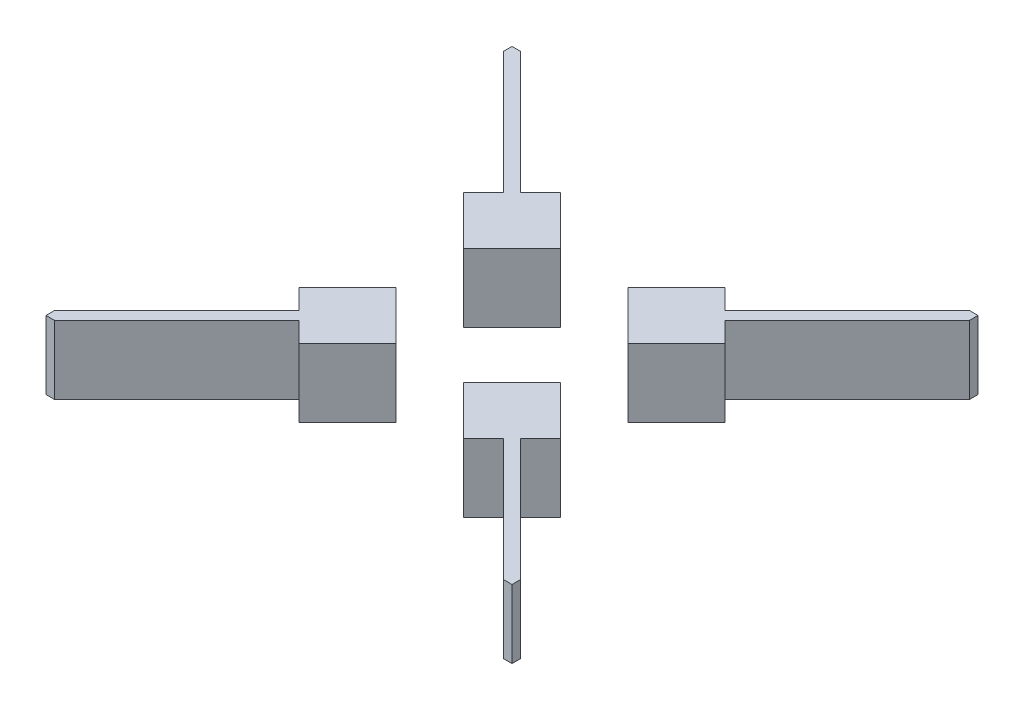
from build123d import *

# Parameters (mm, degrees)
BOSS_EXTRUDE4_DEPTH   = 5
BOSS_EXTRUDE4_2_DEPTH = 5
BOSS_EXTRUDE4_3_DEPTH = 5
BOSS_EXTRUDE4_4_DEPTH = 5


with BuildPart() as part:
    # Sketch1 → Boss-Extrude4 (new body)
    with BuildSketch(Plane(origin=(0, 0, 0), x_dir=(1, 0, 0), z_dir=(0, 1, 0))):
        Polygon((-9.53444211, 5.998908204), (-8.084346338, 7.449003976), (-17, 16.364657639), (-17, 17), (-16.364657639, 17), (-7.449003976, 8.084346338), (-5.998908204, 9.53444211), (-2.463374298, 5.998908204), (-5.998908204, 2.463374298), align=None)
    extrude(amount=BOSS_EXTRUDE4_DEPTH)


with BuildPart() as body_2:
    # Sketch1 → Boss-Extrude4 2 (new body)
    with BuildSketch(Plane(origin=(0, 0, 0), x_dir=(1, 0, 0), z_dir=(0, 1, 0))):
        Polygon((7.449003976, 8.084346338), (5.998908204, 9.53444211), (2.463374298, 5.998908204), (5.998908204, 2.463374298), (9.53444211, 5.998908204), (8.084346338, 7.449003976), (17, 16.364657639), (17, 17), (16.364657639, 17), align=None)
    extrude(amount=BOSS_EXTRUDE4_2_DEPTH)


with BuildPart() as body_3:
    # Sketch1 → Boss-Extrude4 3 (new body)
    with BuildSketch(Plane(origin=(0, 0, 0), x_dir=(1, 0, 0), z_dir=(0, 1, 0))):
        Polygon((9.53444211, -5.998908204), (8.084346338, -7.449003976), (17, -16.364657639), (17, -17), (16.364657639, -17), (7.449003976, -8.084346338), (5.998908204, -9.53444211), (2.463374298, -5.998908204), (5.998908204, -2.463374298), align=None)
    extrude(amount=BOSS_EXTRUDE4_3_DEPTH)


with BuildPart() as body_4:
    # Sketch1 → Boss-Extrude4 4 (new body)
    with BuildSketch(Plane(origin=(0, 0, 0), x_dir=(1, 0, 0), z_dir=(0, 1, 0))):
        Polygon((-7.449003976, -8.084346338), (-5.998908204, -9.53444211), (-2.463374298, -5.998908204), (-5.998908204, -2.463374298), (-9.53444211, -5.998908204), (-8.084346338, -7.449003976), (-17, -16.364657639), (-17, -17), (-16.364657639, -17), align=None)
    extrude(amount=BOSS_EXTRUDE4_4_DEPTH)


solid = Compound([part.part, body_2.part, body_3.part, body_4.part])
